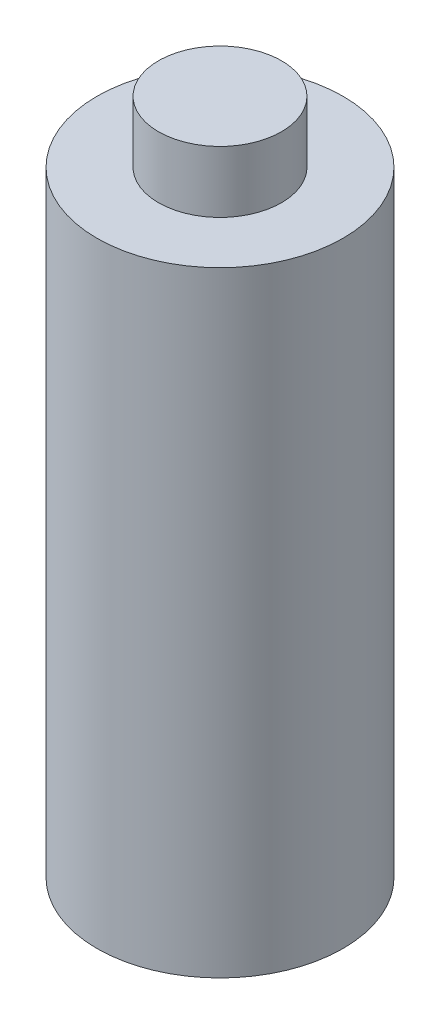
ISO-10303-21;
HEADER;
FILE_DESCRIPTION(('STEP AP214'),'2;1');
FILE_NAME('part.step','',(''),(''),'','','');
FILE_SCHEMA(('AUTOMOTIVE_DESIGN { 1 0 10303 214 1 1 1 1 }'));
ENDSEC;
DATA;
#1=APPLICATION_CONTEXT('core data for automotive mechanical design processes');
#2=APPLICATION_PROTOCOL_DEFINITION('international standard','automotive_design',2000,#1);
#3=PRODUCT_CONTEXT('',#1,'mechanical');
#4=PRODUCT('Part','Part','',(#3));
#5=PRODUCT_RELATED_PRODUCT_CATEGORY('part','',(#4));
#6=PRODUCT_DEFINITION_FORMATION('','',#4);
#7=PRODUCT_DEFINITION_CONTEXT('part definition',#1,'design');
#8=PRODUCT_DEFINITION('design','',#6,#7);
#9=PRODUCT_DEFINITION_SHAPE('','',#8);
#10=(LENGTH_UNIT() NAMED_UNIT(*) SI_UNIT(.MILLI.,.METRE.));
#11=(NAMED_UNIT(*) PLANE_ANGLE_UNIT() SI_UNIT($,.RADIAN.));
#12=(NAMED_UNIT(*) SI_UNIT($,.STERADIAN.) SOLID_ANGLE_UNIT());
#13=UNCERTAINTY_MEASURE_WITH_UNIT(LENGTH_MEASURE(1.E-05),#10,'distance_accuracy_value','');
#14=(GEOMETRIC_REPRESENTATION_CONTEXT(3) GLOBAL_UNCERTAINTY_ASSIGNED_CONTEXT((#13)) GLOBAL_UNIT_ASSIGNED_CONTEXT((#10,
#11,#12)) REPRESENTATION_CONTEXT('',''));
#15=CARTESIAN_POINT('',(0.,0.,0.));
#16=DIRECTION('',(0.,0.,1.));
#17=DIRECTION('',(1.,0.,0.));
#18=AXIS2_PLACEMENT_3D('',#15,#16,#17);
#19=CARTESIAN_POINT('',(0.,200.,0.));
#20=DIRECTION('',(0.,-1.,0.));
#21=DIRECTION('',(0.,0.,-1.));
#22=AXIS2_PLACEMENT_3D('',#19,#20,#21);
#23=CYLINDRICAL_SURFACE('',#22,40.);
#24=CARTESIAN_POINT('',(0.,200.,0.));
#25=DIRECTION('',(0.,1.,0.));
#26=DIRECTION('',(0.,0.,1.));
#27=AXIS2_PLACEMENT_3D('',#24,#25,#26);
#28=CIRCLE('',#27,40.);
#29=CARTESIAN_POINT('',(0.,200.,40.));
#30=VERTEX_POINT('',#29);
#31=EDGE_CURVE('E38',#30,#30,#28,.T.);
#32=ORIENTED_EDGE('',*,*,#31,.F.);
#33=EDGE_LOOP('',(#32));
#34=FACE_BOUND('',#33,.T.);
#35=CARTESIAN_POINT('',(0.,0.,0.));
#36=DIRECTION('',(0.,1.,0.));
#37=DIRECTION('',(0.,0.,1.));
#38=AXIS2_PLACEMENT_3D('',#35,#36,#37);
#39=CIRCLE('',#38,40.);
#40=CARTESIAN_POINT('',(0.,0.,40.));
#41=VERTEX_POINT('',#40);
#42=EDGE_CURVE('E34',#41,#41,#39,.T.);
#43=ORIENTED_EDGE('',*,*,#42,.T.);
#44=EDGE_LOOP('',(#43));
#45=FACE_BOUND('',#44,.T.);
#46=ADVANCED_FACE('F31',(#34,#45),#23,.T.);
#47=CARTESIAN_POINT('',(0.,200.,0.));
#48=DIRECTION('',(0.,1.,0.));
#49=DIRECTION('',(0.,0.,1.));
#50=AXIS2_PLACEMENT_3D('',#47,#48,#49);
#51=PLANE('',#50);
#52=CARTESIAN_POINT('',(0.,200.,0.));
#53=DIRECTION('',(0.,1.,0.));
#54=DIRECTION('',(0.,0.,1.));
#55=AXIS2_PLACEMENT_3D('',#52,#53,#54);
#56=CIRCLE('',#55,20.);
#57=CARTESIAN_POINT('',(0.,200.,20.));
#58=VERTEX_POINT('',#57);
#59=EDGE_CURVE('E10',#58,#58,#56,.T.);
#60=ORIENTED_EDGE('',*,*,#59,.F.);
#61=EDGE_LOOP('',(#60));
#62=FACE_BOUND('',#61,.T.);
#63=ORIENTED_EDGE('',*,*,#31,.T.);
#64=EDGE_LOOP('',(#63));
#65=FACE_BOUND('',#64,.T.);
#66=ADVANCED_FACE('F55',(#62,#65),#51,.T.);
#67=CARTESIAN_POINT('',(0.,0.,0.));
#68=DIRECTION('',(0.,1.,0.));
#69=DIRECTION('',(0.,0.,1.));
#70=AXIS2_PLACEMENT_3D('',#67,#68,#69);
#71=PLANE('',#70);
#72=ORIENTED_EDGE('',*,*,#42,.F.);
#73=EDGE_LOOP('',(#72));
#74=FACE_BOUND('',#73,.T.);
#75=ADVANCED_FACE('F52',(#74),#71,.F.);
#76=CARTESIAN_POINT('',(0.,220.,0.));
#77=DIRECTION('',(0.,-1.,0.));
#78=DIRECTION('',(0.,0.,-1.));
#79=AXIS2_PLACEMENT_3D('',#76,#77,#78);
#80=CYLINDRICAL_SURFACE('',#79,20.);
#81=CARTESIAN_POINT('',(0.,220.,0.));
#82=DIRECTION('',(0.,1.,0.));
#83=DIRECTION('',(0.,0.,1.));
#84=AXIS2_PLACEMENT_3D('',#81,#82,#83);
#85=CIRCLE('',#84,20.);
#86=CARTESIAN_POINT('',(0.,220.,20.));
#87=VERTEX_POINT('',#86);
#88=EDGE_CURVE('E44',#87,#87,#85,.T.);
#89=ORIENTED_EDGE('',*,*,#88,.F.);
#90=EDGE_LOOP('',(#89));
#91=FACE_BOUND('',#90,.T.);
#92=ORIENTED_EDGE('',*,*,#59,.T.);
#93=EDGE_LOOP('',(#92));
#94=FACE_BOUND('',#93,.T.);
#95=ADVANCED_FACE('F54',(#91,#94),#80,.T.);
#96=CARTESIAN_POINT('',(0.,220.,0.));
#97=DIRECTION('',(0.,1.,0.));
#98=DIRECTION('',(0.,0.,1.));
#99=AXIS2_PLACEMENT_3D('',#96,#97,#98);
#100=PLANE('',#99);
#101=ORIENTED_EDGE('',*,*,#88,.T.);
#102=EDGE_LOOP('',(#101));
#103=FACE_BOUND('',#102,.T.);
#104=ADVANCED_FACE('F60',(#103),#100,.T.);
#105=CLOSED_SHELL('',(#46,#66,#75,#95,#104));
#106=MANIFOLD_SOLID_BREP('B2',#105);
#107=ADVANCED_BREP_SHAPE_REPRESENTATION('',(#18,#106),#14);
#108=SHAPE_DEFINITION_REPRESENTATION(#9,#107);
ENDSEC;
END-ISO-10303-21;
